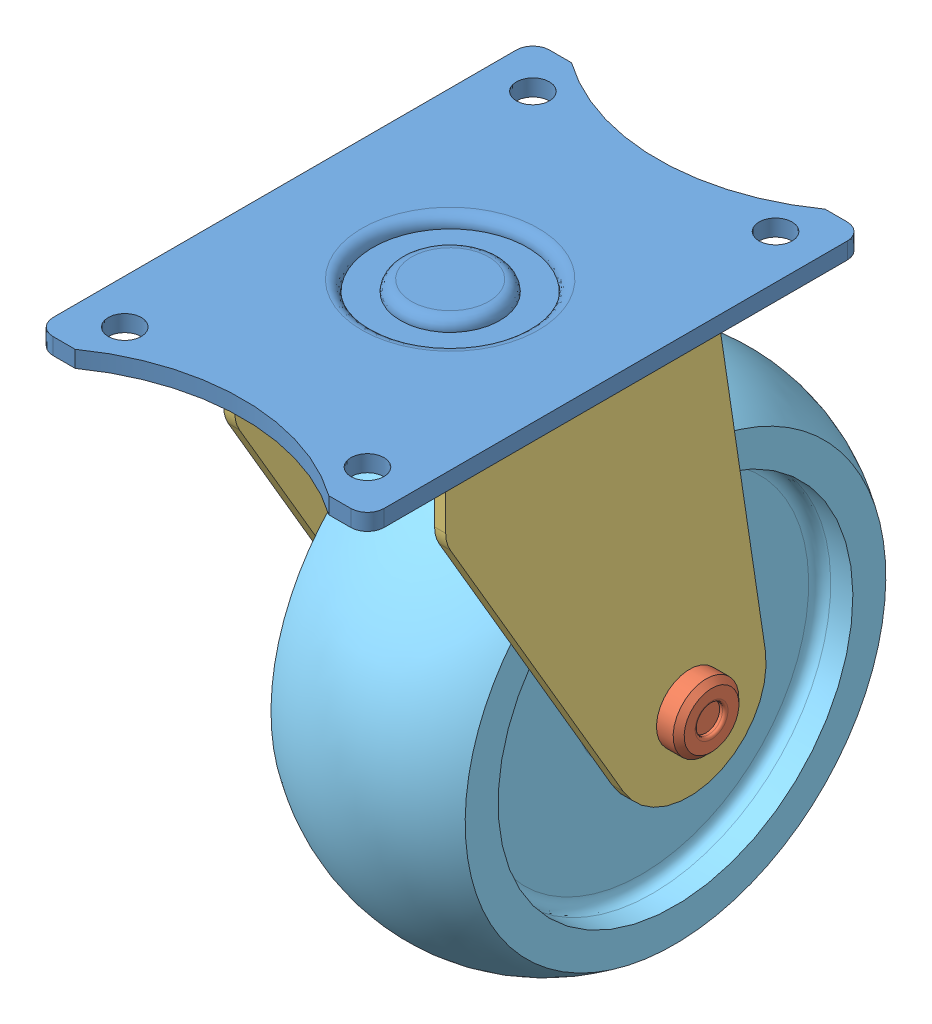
SolidWorks assembly Castor Wheel Assembly.SLDASM, configuration Default (file format 13000). Lengths in mm.
Overall size (60 123.24 122.65).
7 component instances, 7 part files, 12 mates.
Components (placement in the parent):
- Top-1: Top.SLDPRT [Default] at (13.6333 28.3416 29.542) size (60 15.5 90)
- Holder-1: Holder.SLDPRT [Default] at (37.4902 -37.7469 6.0039) x (-0.999981 0 0.006098) z (-0.005423 -0.457338 -0.889276) size (50 12 12)
- HOLDER 2-1: HOLDER 2.SLDPRT [Default] at (-6.5089 -37.7469 6.2722) x (-0.999981 0 0.006098) z (-0.006098 0 -0.999981) size (40 76.09 58.45)
- bottom-1: bottom.SLDPRT [Default] at (13.6333 18.3416 29.542) x (0.999827 0 0.018618) z (-0.018618 0 0.999827) size (27 8 25.19)
- Wheel-1: Wheel.SLDPRT [Default] at (-0.0091 -37.7469 6.2325) x (0.999981 0 -0.006098) z (-0.005876 -0.26699 -0.963681) size (35 88 88)
- washer-1: washer.SLDPRT [Default] at (-7.0089 -37.7469 6.2752) x (0.999981 0 -0.006098) z (0.005821 0.297668 0.954652) size (0.5 10 10)
- Nut-1: Nut.SLDPRT [Default] at (-10.5089 -37.7469 6.2966) x (0.999981 0 -0.006098) z (0.005346 0.481056 0.876673) size (3 10 11.55)
Mates (geometry in assembly coordinates):
- Concentric1: concentric anti-aligned: cylinder of Top-1 through (13.6333 18.3416 29.542) axis (0 1 0) radius 7.5; cylinder of bottom-1 through (13.6333 18.3416 29.542) axis (0 -1 0) radius 7.5
- Coincident1: coincident anti-aligned: plane of Top-1 through (13.6333 26.3416 29.542) normal (0 -1 0); plane of bottom-1 through (21.132 26.3416 29.6816) normal (0 1 0)
- Concentric2: concentric anti-aligned: cylinder of HOLDER 2-1 through (13.6333 20.3416 29.542) axis (0 1 0) radius 10; cylinder of bottom-1 through (13.6333 18.3416 29.542) axis (0 -1 0) radius 9.5
- Coincident2: coincident anti-aligned: plane of HOLDER 2-1 through (-4.5428 24.3416 0.7144) normal (0 1 0); plane of bottom-1 through (27.131 24.3416 29.7933) normal (0 -1 0)
- Concentric3: concentric anti-aligned: cylinder of Holder-1 through (4.4909 -37.7469 6.2051) axis (0.999981 0 -0.006098) radius 4; cylinder of HOLDER 2-1 through (-10.5089 -37.7469 6.2966) axis (-0.999981 0 0.006098) radius 4
- Coincident3: coincident anti-aligned: plane of Holder-1 through (33.4903 -37.7469 6.0283) normal (-0.999981 0 0.006098); plane of HOLDER 2-1 through (33.7614 22.3416 50.4818) normal (0.999981 0 -0.006098)
- Concentric4: concentric anti-aligned: cylinder of Holder-1 through (4.4909 -37.7469 6.2051) axis (0.999981 0 -0.006098) radius 4; cylinder of Wheel-1 through (-0.0091 -37.7469 6.2325) axis (-0.999981 0 0.006098) radius 4
- Width1: width anti-aligned: plane of Wheel-1 through (-3.9563 -68.9389 14.8984) normal (-0.999981 0 0.006098); plane of HOLDER 2-1 through (31.0528 -74.7211 16.2869) normal (0.999981 0 -0.006098); plane of Wheel-1 through (-4.509 -37.7469 6.26) normal (0.999981 0 -0.006098); plane of HOLDER 2-1 through (31.4904 -37.7469 6.0405) normal (-0.999981 0 0.006098)
- Concentric5: concentric anti-aligned: cylinder of Holder-1 through (-12.5088 -37.7469 6.3088) axis (0.999981 0 -0.006098) radius 2.5; cylinder of washer-1 through (-6.5089 -37.7469 6.2722) axis (-0.999981 0 0.006098) radius 2.5
- Coincident4: coincident anti-aligned: plane of HOLDER 2-1 through (-6.5089 -37.7469 6.2722) normal (-0.999981 0 0.006098); plane of washer-1 through (-6.5089 -37.7469 6.2722) normal (0.999981 0 -0.006098)
- Concentric6: concentric anti-aligned: cylinder of Holder-1 through (-12.5088 -37.7469 6.3088) axis (0.999981 0 -0.006098) radius 2.5; cylinder of Nut-1 through (-7.5089 -37.7469 6.2783) axis (-0.999981 0 0.006098) radius 2.5
- Distance1: distance = 0.5 mm anti-aligned: plane of Nut-1 through (-7.5089 -37.7469 6.2783) normal (0.999981 0 -0.006098); plane of washer-1 through (-7.0089 -37.7469 6.2752) normal (-0.999981 0 0.006098)
